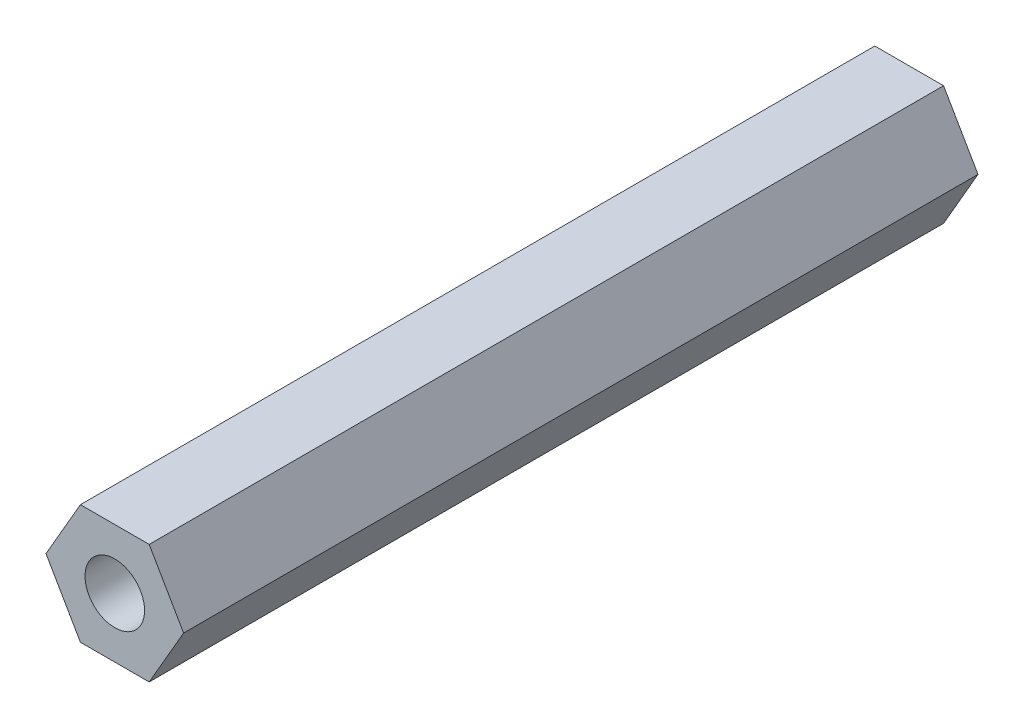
from build123d import *

# Parameters (mm, degrees)
SKETCH_1_R      = 1.5
EXTRUDE_1_DEPTH = 20


with BuildPart() as part:
    # Sketch 1 → Extrude 1 (new, symmetric)
    with BuildSketch(Plane.XY):
        Polygon((3.464101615, 0), (1.732050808, 3), (-1.732050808, 3), (-3.464101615, 0), (-1.732050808, -3), (1.732050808, -3), align=None)
        Circle(SKETCH_1_R, mode=Mode.SUBTRACT)
    extrude(amount=EXTRUDE_1_DEPTH, both=True)


solid = part.part
